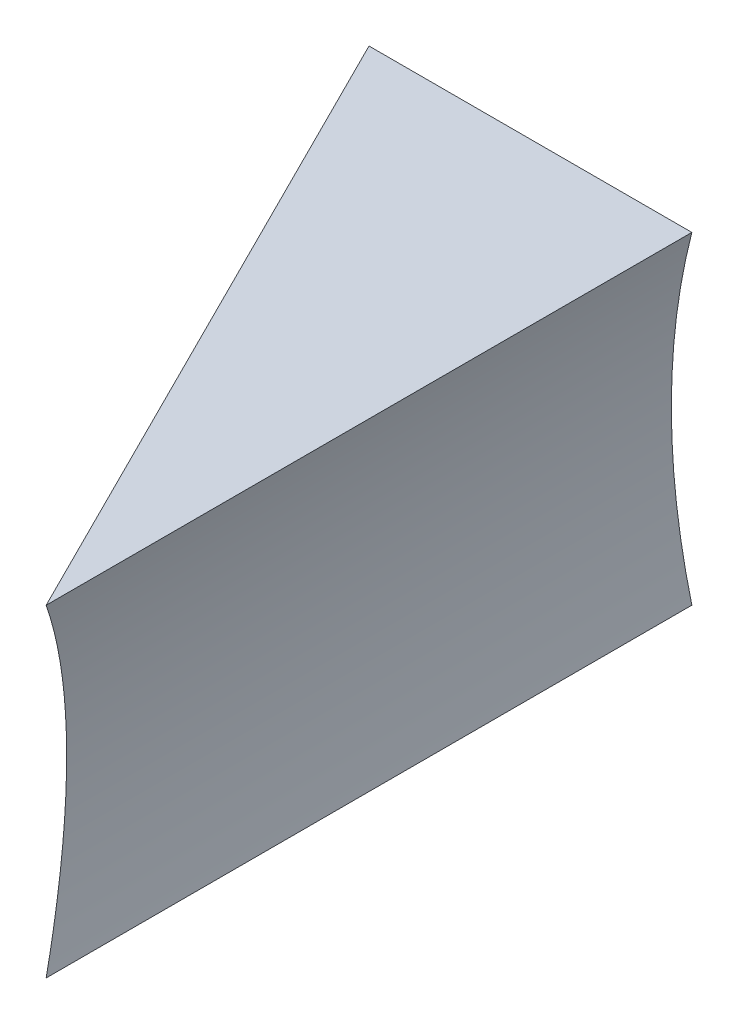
ISO-10303-21;
HEADER;
FILE_DESCRIPTION(('STEP AP214'),'2;1');
FILE_NAME('part.step','',(''),(''),'','','');
FILE_SCHEMA(('AUTOMOTIVE_DESIGN { 1 0 10303 214 1 1 1 1 }'));
ENDSEC;
DATA;
#1=APPLICATION_CONTEXT('core data for automotive mechanical design processes');
#2=APPLICATION_PROTOCOL_DEFINITION('international standard','automotive_design',2000,#1);
#3=PRODUCT_CONTEXT('',#1,'mechanical');
#4=PRODUCT('Part','Part','',(#3));
#5=PRODUCT_RELATED_PRODUCT_CATEGORY('part','',(#4));
#6=PRODUCT_DEFINITION_FORMATION('','',#4);
#7=PRODUCT_DEFINITION_CONTEXT('part definition',#1,'design');
#8=PRODUCT_DEFINITION('design','',#6,#7);
#9=PRODUCT_DEFINITION_SHAPE('','',#8);
#10=(LENGTH_UNIT() NAMED_UNIT(*) SI_UNIT(.MILLI.,.METRE.));
#11=(NAMED_UNIT(*) PLANE_ANGLE_UNIT() SI_UNIT($,.RADIAN.));
#12=(NAMED_UNIT(*) SI_UNIT($,.STERADIAN.) SOLID_ANGLE_UNIT());
#13=UNCERTAINTY_MEASURE_WITH_UNIT(LENGTH_MEASURE(1.E-05),#10,'distance_accuracy_value','');
#14=(GEOMETRIC_REPRESENTATION_CONTEXT(3) GLOBAL_UNCERTAINTY_ASSIGNED_CONTEXT((#13)) GLOBAL_UNIT_ASSIGNED_CONTEXT((#10,
#11,#12)) REPRESENTATION_CONTEXT('',''));
#15=CARTESIAN_POINT('',(0.,0.,0.));
#16=DIRECTION('',(0.,0.,1.));
#17=DIRECTION('',(1.,0.,0.));
#18=AXIS2_PLACEMENT_3D('',#15,#16,#17);
#19=CARTESIAN_POINT('',(0.,0.,50.));
#20=DIRECTION('',(0.,0.,-1.));
#21=DIRECTION('',(-1.,0.,0.));
#22=AXIS2_PLACEMENT_3D('',#19,#20,#21);
#23=CYLINDRICAL_SURFACE('',#22,50.);
#24=DIRECTION('',(0.,0.,-1.));
#25=VECTOR('',#24,1.);
#26=CARTESIAN_POINT('',(-48.4122918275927,12.5,50.));
#27=LINE('',#26,#25);
#28=CARTESIAN_POINT('',(-48.4122918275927,12.5,50.));
#29=VERTEX_POINT('',#28);
#30=CARTESIAN_POINT('',(-48.4122918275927,12.5,0.));
#31=VERTEX_POINT('',#30);
#32=EDGE_CURVE('E39',#29,#31,#27,.T.);
#33=ORIENTED_EDGE('',*,*,#32,.F.);
#34=CARTESIAN_POINT('',(0.,0.,146.824583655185));
#35=DIRECTION('',(-0.894427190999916,0.,0.447213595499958));
#36=DIRECTION('',(-0.447213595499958,0.,-0.894427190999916));
#37=AXIS2_PLACEMENT_3D('',#34,#35,#36);
#38=ELLIPSE('',#37,111.80339887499,50.);
#39=CARTESIAN_POINT('',(-48.4122918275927,-12.5,50.));
#40=VERTEX_POINT('',#39);
#41=EDGE_CURVE('E67',#29,#40,#38,.T.);
#42=ORIENTED_EDGE('',*,*,#41,.T.);
#43=DIRECTION('',(0.,0.,-1.));
#44=VECTOR('',#43,1.);
#45=CARTESIAN_POINT('',(-48.4122918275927,-12.5,50.));
#46=LINE('',#45,#44);
#47=CARTESIAN_POINT('',(-48.4122918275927,-12.5,0.));
#48=VERTEX_POINT('',#47);
#49=EDGE_CURVE('E72',#40,#48,#46,.T.);
#50=ORIENTED_EDGE('',*,*,#49,.T.);
#51=CARTESIAN_POINT('',(0.,0.,0.));
#52=DIRECTION('',(0.,0.,1.));
#53=DIRECTION('',(1.,0.,0.));
#54=AXIS2_PLACEMENT_3D('',#51,#52,#53);
#55=CIRCLE('',#54,50.);
#56=EDGE_CURVE('E82',#31,#48,#55,.T.);
#57=ORIENTED_EDGE('',*,*,#56,.F.);
#58=EDGE_LOOP('',(#33,#42,#50,#57));
#59=FACE_BOUND('',#58,.T.);
#60=ADVANCED_FACE('F32',(#59),#23,.F.);
#61=CARTESIAN_POINT('',(-16.0792804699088,12.5,50.));
#62=DIRECTION('',(0.,1.,0.));
#63=DIRECTION('',(-1.,0.,0.));
#64=AXIS2_PLACEMENT_3D('',#61,#62,#63);
#65=PLANE('',#64);
#66=DIRECTION('',(1.,0.,0.));
#67=VECTOR('',#66,1.);
#68=CARTESIAN_POINT('',(-16.0792804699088,12.5,0.));
#69=LINE('',#68,#67);
#70=CARTESIAN_POINT('',(-73.4122918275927,12.5,0.));
#71=VERTEX_POINT('',#70);
#72=EDGE_CURVE('E78',#71,#31,#69,.T.);
#73=ORIENTED_EDGE('',*,*,#72,.F.);
#74=DIRECTION('',(0.447213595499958,0.,0.894427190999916));
#75=VECTOR('',#74,1.);
#76=CARTESIAN_POINT('',(-41.9456895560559,12.5,62.9332045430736));
#77=LINE('',#76,#75);
#78=EDGE_CURVE('E45',#71,#29,#77,.T.);
#79=ORIENTED_EDGE('',*,*,#78,.T.);
#80=ORIENTED_EDGE('',*,*,#32,.T.);
#81=EDGE_LOOP('',(#73,#79,#80));
#82=FACE_BOUND('',#81,.T.);
#83=ADVANCED_FACE('F86',(#82),#65,.T.);
#84=CARTESIAN_POINT('',(-16.0792804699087,-12.5,50.));
#85=DIRECTION('',(0.,1.,0.));
#86=DIRECTION('',(-1.,0.,0.));
#87=AXIS2_PLACEMENT_3D('',#84,#85,#86);
#88=PLANE('',#87);
#89=DIRECTION('',(0.447213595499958,0.,0.894427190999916));
#90=VECTOR('',#89,1.);
#91=CARTESIAN_POINT('',(-41.9456895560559,-12.5,62.9332045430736));
#92=LINE('',#91,#90);
#93=CARTESIAN_POINT('',(-73.4122918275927,-12.5,0.));
#94=VERTEX_POINT('',#93);
#95=EDGE_CURVE('E64',#94,#40,#92,.T.);
#96=ORIENTED_EDGE('',*,*,#95,.F.);
#97=DIRECTION('',(1.,0.,0.));
#98=VECTOR('',#97,1.);
#99=CARTESIAN_POINT('',(-16.0792804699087,-12.5,0.));
#100=LINE('',#99,#98);
#101=EDGE_CURVE('E53',#94,#48,#100,.T.);
#102=ORIENTED_EDGE('',*,*,#101,.T.);
#103=ORIENTED_EDGE('',*,*,#49,.F.);
#104=EDGE_LOOP('',(#96,#102,#103));
#105=FACE_BOUND('',#104,.T.);
#106=ADVANCED_FACE('F76',(#105),#88,.F.);
#107=CARTESIAN_POINT('',(-16.0792804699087,-135.154911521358,0.));
#108=DIRECTION('',(0.,0.,1.));
#109=DIRECTION('',(1.,0.,0.));
#110=AXIS2_PLACEMENT_3D('',#107,#108,#109);
#111=PLANE('',#110);
#112=DIRECTION('',(0.,-1.,0.));
#113=VECTOR('',#112,1.);
#114=CARTESIAN_POINT('',(-73.4122918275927,-135.154911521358,0.));
#115=LINE('',#114,#113);
#116=EDGE_CURVE('E12',#71,#94,#115,.T.);
#117=ORIENTED_EDGE('',*,*,#116,.F.);
#118=ORIENTED_EDGE('',*,*,#72,.T.);
#119=ORIENTED_EDGE('',*,*,#56,.T.);
#120=ORIENTED_EDGE('',*,*,#101,.F.);
#121=EDGE_LOOP('',(#117,#118,#119,#120));
#122=FACE_BOUND('',#121,.T.);
#123=ADVANCED_FACE('F88',(#122),#111,.F.);
#124=CARTESIAN_POINT('',(-48.4122918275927,-30.,50.));
#125=DIRECTION('',(-0.894427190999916,0.,0.447213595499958));
#126=DIRECTION('',(0.447213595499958,0.,0.894427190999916));
#127=AXIS2_PLACEMENT_3D('',#124,#125,#126);
#128=PLANE('',#127);
#129=ORIENTED_EDGE('',*,*,#116,.T.);
#130=ORIENTED_EDGE('',*,*,#95,.T.);
#131=ORIENTED_EDGE('',*,*,#41,.F.);
#132=ORIENTED_EDGE('',*,*,#78,.F.);
#133=EDGE_LOOP('',(#129,#130,#131,#132));
#134=FACE_BOUND('',#133,.T.);
#135=ADVANCED_FACE('F66',(#134),#128,.T.);
#136=CLOSED_SHELL('',(#60,#83,#106,#123,#135));
#137=MANIFOLD_SOLID_BREP('B2',#136);
#138=ADVANCED_BREP_SHAPE_REPRESENTATION('',(#18,#137),#14);
#139=SHAPE_DEFINITION_REPRESENTATION(#9,#138);
ENDSEC;
END-ISO-10303-21;
